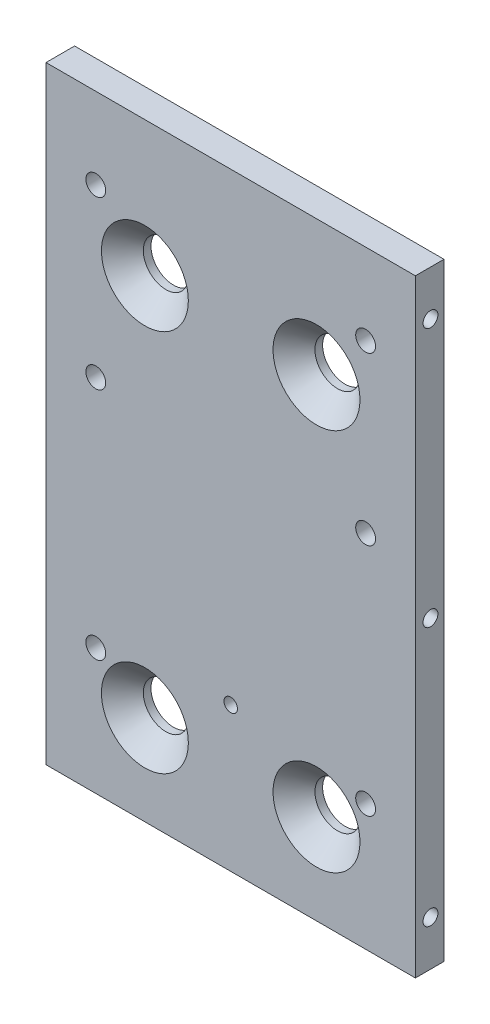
ISO-10303-21;
HEADER;
FILE_DESCRIPTION(('STEP AP214'),'2;1');
FILE_NAME('part.step','',(''),(''),'','','');
FILE_SCHEMA(('AUTOMOTIVE_DESIGN { 1 0 10303 214 1 1 1 1 }'));
ENDSEC;
DATA;
#1=APPLICATION_CONTEXT('core data for automotive mechanical design processes');
#2=APPLICATION_PROTOCOL_DEFINITION('international standard','automotive_design',2000,#1);
#3=PRODUCT_CONTEXT('',#1,'mechanical');
#4=PRODUCT('Part','Part','',(#3));
#5=PRODUCT_RELATED_PRODUCT_CATEGORY('part','',(#4));
#6=PRODUCT_DEFINITION_FORMATION('','',#4);
#7=PRODUCT_DEFINITION_CONTEXT('part definition',#1,'design');
#8=PRODUCT_DEFINITION('design','',#6,#7);
#9=PRODUCT_DEFINITION_SHAPE('','',#8);
#10=(LENGTH_UNIT() NAMED_UNIT(*) SI_UNIT(.MILLI.,.METRE.));
#11=(NAMED_UNIT(*) PLANE_ANGLE_UNIT() SI_UNIT($,.RADIAN.));
#12=(NAMED_UNIT(*) SI_UNIT($,.STERADIAN.) SOLID_ANGLE_UNIT());
#13=UNCERTAINTY_MEASURE_WITH_UNIT(LENGTH_MEASURE(1.E-05),#10,'distance_accuracy_value','');
#14=(GEOMETRIC_REPRESENTATION_CONTEXT(3) GLOBAL_UNCERTAINTY_ASSIGNED_CONTEXT((#13)) GLOBAL_UNIT_ASSIGNED_CONTEXT((#10,
#11,#12)) REPRESENTATION_CONTEXT('',''));
#15=CARTESIAN_POINT('',(0.,0.,0.));
#16=DIRECTION('',(0.,0.,1.));
#17=DIRECTION('',(1.,0.,0.));
#18=AXIS2_PLACEMENT_3D('',#15,#16,#17);
#19=CARTESIAN_POINT('',(0.,0.,6.35));
#20=DIRECTION('',(0.,0.,-1.));
#21=DIRECTION('',(-1.,0.,0.));
#22=AXIS2_PLACEMENT_3D('',#19,#20,#21);
#23=PLANE('',#22);
#24=CARTESIAN_POINT('',(29.95,-39.5,6.34999999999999));
#25=DIRECTION('',(0.,0.,-1.));
#26=DIRECTION('',(-1.,0.,0.));
#27=AXIS2_PLACEMENT_3D('',#24,#25,#26);
#28=CIRCLE('',#27,2.20000000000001);
#29=CARTESIAN_POINT('',(27.75,-39.5,6.34999999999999));
#30=VERTEX_POINT('',#29);
#31=EDGE_CURVE('E225',#30,#30,#28,.T.);
#32=ORIENTED_EDGE('',*,*,#31,.T.);
#33=EDGE_LOOP('',(#32));
#34=FACE_BOUND('',#33,.T.);
#35=CARTESIAN_POINT('',(29.95,12.5,6.34999999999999));
#36=DIRECTION('',(0.,0.,-1.));
#37=DIRECTION('',(-1.,0.,0.));
#38=AXIS2_PLACEMENT_3D('',#35,#36,#37);
#39=CIRCLE('',#38,2.20000000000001);
#40=CARTESIAN_POINT('',(27.75,12.5,6.34999999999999));
#41=VERTEX_POINT('',#40);
#42=EDGE_CURVE('E213',#41,#41,#39,.T.);
#43=ORIENTED_EDGE('',*,*,#42,.T.);
#44=EDGE_LOOP('',(#43));
#45=FACE_BOUND('',#44,.T.);
#46=CARTESIAN_POINT('',(29.95,49.5,6.34999999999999));
#47=DIRECTION('',(0.,0.,-1.));
#48=DIRECTION('',(-1.,0.,0.));
#49=AXIS2_PLACEMENT_3D('',#46,#47,#48);
#50=CIRCLE('',#49,2.20000000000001);
#51=CARTESIAN_POINT('',(27.75,49.5,6.34999999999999));
#52=VERTEX_POINT('',#51);
#53=EDGE_CURVE('E201',#52,#52,#50,.T.);
#54=ORIENTED_EDGE('',*,*,#53,.T.);
#55=EDGE_LOOP('',(#54));
#56=FACE_BOUND('',#55,.T.);
#57=CARTESIAN_POINT('',(-29.95,49.5,6.34999999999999));
#58=DIRECTION('',(0.,0.,-1.));
#59=DIRECTION('',(-1.,0.,0.));
#60=AXIS2_PLACEMENT_3D('',#57,#58,#59);
#61=CIRCLE('',#60,2.20000000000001);
#62=CARTESIAN_POINT('',(-32.15,49.5,6.34999999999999));
#63=VERTEX_POINT('',#62);
#64=EDGE_CURVE('E189',#63,#63,#61,.T.);
#65=ORIENTED_EDGE('',*,*,#64,.T.);
#66=EDGE_LOOP('',(#65));
#67=FACE_BOUND('',#66,.T.);
#68=CARTESIAN_POINT('',(-29.95,12.5,6.34999999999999));
#69=DIRECTION('',(0.,0.,-1.));
#70=DIRECTION('',(-1.,0.,0.));
#71=AXIS2_PLACEMENT_3D('',#68,#69,#70);
#72=CIRCLE('',#71,2.20000000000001);
#73=CARTESIAN_POINT('',(-32.15,12.5,6.34999999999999));
#74=VERTEX_POINT('',#73);
#75=EDGE_CURVE('E177',#74,#74,#72,.T.);
#76=ORIENTED_EDGE('',*,*,#75,.T.);
#77=EDGE_LOOP('',(#76));
#78=FACE_BOUND('',#77,.T.);
#79=CARTESIAN_POINT('',(-29.95,-39.5,6.34999999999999));
#80=DIRECTION('',(0.,0.,-1.));
#81=DIRECTION('',(-1.,0.,0.));
#82=AXIS2_PLACEMENT_3D('',#79,#80,#81);
#83=CIRCLE('',#82,2.20000000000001);
#84=CARTESIAN_POINT('',(-32.15,-39.5,6.34999999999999));
#85=VERTEX_POINT('',#84);
#86=EDGE_CURVE('E163',#85,#85,#83,.T.);
#87=ORIENTED_EDGE('',*,*,#86,.T.);
#88=EDGE_LOOP('',(#87));
#89=FACE_BOUND('',#88,.T.);
#90=CARTESIAN_POINT('',(0.,-35.5,6.35));
#91=DIRECTION('',(0.,0.,-1.));
#92=DIRECTION('',(-1.,0.,0.));
#93=AXIS2_PLACEMENT_3D('',#90,#91,#92);
#94=CIRCLE('',#93,1.5);
#95=CARTESIAN_POINT('',(-1.5,-35.5,6.35));
#96=VERTEX_POINT('',#95);
#97=EDGE_CURVE('E159',#96,#96,#94,.T.);
#98=ORIENTED_EDGE('',*,*,#97,.T.);
#99=EDGE_LOOP('',(#98));
#100=FACE_BOUND('',#99,.T.);
#101=CARTESIAN_POINT('',(-19.05,37.5,6.35));
#102=DIRECTION('',(0.,0.,1.));
#103=DIRECTION('',(1.,0.,0.));
#104=AXIS2_PLACEMENT_3D('',#101,#102,#103);
#105=CIRCLE('',#104,9.65);
#106=CARTESIAN_POINT('',(-9.4,37.5,6.35));
#107=VERTEX_POINT('',#106);
#108=EDGE_CURVE('E156',#107,#107,#105,.T.);
#109=ORIENTED_EDGE('',*,*,#108,.F.);
#110=EDGE_LOOP('',(#109));
#111=FACE_BOUND('',#110,.T.);
#112=CARTESIAN_POINT('',(19.05,37.5,6.35));
#113=DIRECTION('',(0.,0.,1.));
#114=DIRECTION('',(1.,0.,0.));
#115=AXIS2_PLACEMENT_3D('',#112,#113,#114);
#116=CIRCLE('',#115,9.65);
#117=CARTESIAN_POINT('',(28.7,37.5,6.35));
#118=VERTEX_POINT('',#117);
#119=EDGE_CURVE('E147',#118,#118,#116,.T.);
#120=ORIENTED_EDGE('',*,*,#119,.F.);
#121=EDGE_LOOP('',(#120));
#122=FACE_BOUND('',#121,.T.);
#123=CARTESIAN_POINT('',(-19.05,-47.5,6.35));
#124=DIRECTION('',(0.,0.,1.));
#125=DIRECTION('',(1.,0.,0.));
#126=AXIS2_PLACEMENT_3D('',#123,#124,#125);
#127=CIRCLE('',#126,9.65);
#128=CARTESIAN_POINT('',(-9.4,-47.5,6.35));
#129=VERTEX_POINT('',#128);
#130=EDGE_CURVE('E138',#129,#129,#127,.T.);
#131=ORIENTED_EDGE('',*,*,#130,.F.);
#132=EDGE_LOOP('',(#131));
#133=FACE_BOUND('',#132,.T.);
#134=DIRECTION('',(0.,-1.,0.));
#135=VECTOR('',#134,1.);
#136=CARTESIAN_POINT('',(-41.,67.5,6.35));
#137=LINE('',#136,#135);
#138=CARTESIAN_POINT('',(-41.,67.5,6.35));
#139=VERTEX_POINT('',#138);
#140=CARTESIAN_POINT('',(-41.,-67.5,6.35));
#141=VERTEX_POINT('',#140);
#142=EDGE_CURVE('E97',#139,#141,#137,.T.);
#143=ORIENTED_EDGE('',*,*,#142,.T.);
#144=DIRECTION('',(1.,0.,0.));
#145=VECTOR('',#144,1.);
#146=CARTESIAN_POINT('',(41.,-67.5,6.35));
#147=LINE('',#146,#145);
#148=CARTESIAN_POINT('',(41.,-67.5,6.35));
#149=VERTEX_POINT('',#148);
#150=EDGE_CURVE('E92',#141,#149,#147,.T.);
#151=ORIENTED_EDGE('',*,*,#150,.T.);
#152=DIRECTION('',(0.,1.,0.));
#153=VECTOR('',#152,1.);
#154=CARTESIAN_POINT('',(41.,67.5,6.35));
#155=LINE('',#154,#153);
#156=CARTESIAN_POINT('',(41.,67.5,6.35));
#157=VERTEX_POINT('',#156);
#158=EDGE_CURVE('E95',#149,#157,#155,.T.);
#159=ORIENTED_EDGE('',*,*,#158,.T.);
#160=DIRECTION('',(-1.,0.,0.));
#161=VECTOR('',#160,1.);
#162=CARTESIAN_POINT('',(41.,67.5,6.35));
#163=LINE('',#162,#161);
#164=EDGE_CURVE('E62',#157,#139,#163,.T.);
#165=ORIENTED_EDGE('',*,*,#164,.T.);
#166=EDGE_LOOP('',(#143,#151,#159,#165));
#167=FACE_BOUND('',#166,.T.);
#168=CARTESIAN_POINT('',(19.05,-47.5,6.35));
#169=DIRECTION('',(0.,0.,1.));
#170=DIRECTION('',(1.,0.,0.));
#171=AXIS2_PLACEMENT_3D('',#168,#169,#170);
#172=CIRCLE('',#171,9.65);
#173=CARTESIAN_POINT('',(28.7,-47.5,6.35));
#174=VERTEX_POINT('',#173);
#175=EDGE_CURVE('E129',#174,#174,#172,.T.);
#176=ORIENTED_EDGE('',*,*,#175,.F.);
#177=EDGE_LOOP('',(#176));
#178=FACE_BOUND('',#177,.T.);
#179=ADVANCED_FACE('F45',(#34,#45,#56,#67,#78,#89,#100,#111,#122,#133,#167,#178),#23,.F.);
#180=CARTESIAN_POINT('',(0.,0.,0.));
#181=DIRECTION('',(0.,0.,-1.));
#182=DIRECTION('',(-1.,0.,0.));
#183=AXIS2_PLACEMENT_3D('',#180,#181,#182);
#184=PLANE('',#183);
#185=CARTESIAN_POINT('',(29.95,-39.5,0.));
#186=DIRECTION('',(0.,0.,-1.));
#187=DIRECTION('',(-1.,0.,0.));
#188=AXIS2_PLACEMENT_3D('',#185,#186,#187);
#189=CIRCLE('',#188,3.75000000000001);
#190=CARTESIAN_POINT('',(26.2,-39.5,0.));
#191=VERTEX_POINT('',#190);
#192=EDGE_CURVE('E234',#191,#191,#189,.T.);
#193=ORIENTED_EDGE('',*,*,#192,.F.);
#194=EDGE_LOOP('',(#193));
#195=FACE_BOUND('',#194,.T.);
#196=CARTESIAN_POINT('',(29.95,12.5,0.));
#197=DIRECTION('',(0.,0.,-1.));
#198=DIRECTION('',(-1.,0.,0.));
#199=AXIS2_PLACEMENT_3D('',#196,#197,#198);
#200=CIRCLE('',#199,3.75000000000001);
#201=CARTESIAN_POINT('',(26.2,12.5,0.));
#202=VERTEX_POINT('',#201);
#203=EDGE_CURVE('E222',#202,#202,#200,.T.);
#204=ORIENTED_EDGE('',*,*,#203,.F.);
#205=EDGE_LOOP('',(#204));
#206=FACE_BOUND('',#205,.T.);
#207=CARTESIAN_POINT('',(29.95,49.5,0.));
#208=DIRECTION('',(0.,0.,-1.));
#209=DIRECTION('',(-1.,0.,0.));
#210=AXIS2_PLACEMENT_3D('',#207,#208,#209);
#211=CIRCLE('',#210,3.75000000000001);
#212=CARTESIAN_POINT('',(26.2,49.5,0.));
#213=VERTEX_POINT('',#212);
#214=EDGE_CURVE('E210',#213,#213,#211,.T.);
#215=ORIENTED_EDGE('',*,*,#214,.F.);
#216=EDGE_LOOP('',(#215));
#217=FACE_BOUND('',#216,.T.);
#218=CARTESIAN_POINT('',(-29.95,49.5,0.));
#219=DIRECTION('',(0.,0.,-1.));
#220=DIRECTION('',(-1.,0.,0.));
#221=AXIS2_PLACEMENT_3D('',#218,#219,#220);
#222=CIRCLE('',#221,3.75000000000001);
#223=CARTESIAN_POINT('',(-33.7,49.5,0.));
#224=VERTEX_POINT('',#223);
#225=EDGE_CURVE('E198',#224,#224,#222,.T.);
#226=ORIENTED_EDGE('',*,*,#225,.F.);
#227=EDGE_LOOP('',(#226));
#228=FACE_BOUND('',#227,.T.);
#229=CARTESIAN_POINT('',(-29.95,12.5,0.));
#230=DIRECTION('',(0.,0.,-1.));
#231=DIRECTION('',(-1.,0.,0.));
#232=AXIS2_PLACEMENT_3D('',#229,#230,#231);
#233=CIRCLE('',#232,3.75000000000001);
#234=CARTESIAN_POINT('',(-33.7,12.5,0.));
#235=VERTEX_POINT('',#234);
#236=EDGE_CURVE('E186',#235,#235,#233,.T.);
#237=ORIENTED_EDGE('',*,*,#236,.F.);
#238=EDGE_LOOP('',(#237));
#239=FACE_BOUND('',#238,.T.);
#240=CARTESIAN_POINT('',(-29.95,-39.5,0.));
#241=DIRECTION('',(0.,0.,-1.));
#242=DIRECTION('',(-1.,0.,0.));
#243=AXIS2_PLACEMENT_3D('',#240,#241,#242);
#244=CIRCLE('',#243,3.75000000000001);
#245=CARTESIAN_POINT('',(-33.7,-39.5,0.));
#246=VERTEX_POINT('',#245);
#247=EDGE_CURVE('E174',#246,#246,#244,.T.);
#248=ORIENTED_EDGE('',*,*,#247,.F.);
#249=EDGE_LOOP('',(#248));
#250=FACE_BOUND('',#249,.T.);
#251=CARTESIAN_POINT('',(0.,-35.5,0.));
#252=DIRECTION('',(0.,0.,-1.));
#253=DIRECTION('',(-1.,0.,0.));
#254=AXIS2_PLACEMENT_3D('',#251,#252,#253);
#255=CIRCLE('',#254,1.5);
#256=CARTESIAN_POINT('',(-1.5,-35.5,0.));
#257=VERTEX_POINT('',#256);
#258=EDGE_CURVE('E160',#257,#257,#255,.T.);
#259=ORIENTED_EDGE('',*,*,#258,.F.);
#260=EDGE_LOOP('',(#259));
#261=FACE_BOUND('',#260,.T.);
#262=CARTESIAN_POINT('',(-19.05,37.5,0.));
#263=DIRECTION('',(0.,0.,1.));
#264=DIRECTION('',(1.,0.,0.));
#265=AXIS2_PLACEMENT_3D('',#262,#263,#264);
#266=CIRCLE('',#265,5.);
#267=CARTESIAN_POINT('',(-14.05,37.5,0.));
#268=VERTEX_POINT('',#267);
#269=EDGE_CURVE('E150',#268,#268,#266,.T.);
#270=ORIENTED_EDGE('',*,*,#269,.T.);
#271=EDGE_LOOP('',(#270));
#272=FACE_BOUND('',#271,.T.);
#273=CARTESIAN_POINT('',(19.05,37.5,0.));
#274=DIRECTION('',(0.,0.,1.));
#275=DIRECTION('',(1.,0.,0.));
#276=AXIS2_PLACEMENT_3D('',#273,#274,#275);
#277=CIRCLE('',#276,5.);
#278=CARTESIAN_POINT('',(24.05,37.5,0.));
#279=VERTEX_POINT('',#278);
#280=EDGE_CURVE('E141',#279,#279,#277,.T.);
#281=ORIENTED_EDGE('',*,*,#280,.T.);
#282=EDGE_LOOP('',(#281));
#283=FACE_BOUND('',#282,.T.);
#284=CARTESIAN_POINT('',(-19.05,-47.5,0.));
#285=DIRECTION('',(0.,0.,1.));
#286=DIRECTION('',(1.,0.,0.));
#287=AXIS2_PLACEMENT_3D('',#284,#285,#286);
#288=CIRCLE('',#287,5.);
#289=CARTESIAN_POINT('',(-14.05,-47.5,0.));
#290=VERTEX_POINT('',#289);
#291=EDGE_CURVE('E132',#290,#290,#288,.T.);
#292=ORIENTED_EDGE('',*,*,#291,.T.);
#293=EDGE_LOOP('',(#292));
#294=FACE_BOUND('',#293,.T.);
#295=DIRECTION('',(0.,-1.,0.));
#296=VECTOR('',#295,1.);
#297=CARTESIAN_POINT('',(-41.,67.5,0.));
#298=LINE('',#297,#296);
#299=CARTESIAN_POINT('',(-41.,67.5,0.));
#300=VERTEX_POINT('',#299);
#301=CARTESIAN_POINT('',(-41.,-67.5,0.));
#302=VERTEX_POINT('',#301);
#303=EDGE_CURVE('E109',#300,#302,#298,.T.);
#304=ORIENTED_EDGE('',*,*,#303,.F.);
#305=DIRECTION('',(-1.,0.,0.));
#306=VECTOR('',#305,1.);
#307=CARTESIAN_POINT('',(41.,67.5,0.));
#308=LINE('',#307,#306);
#309=CARTESIAN_POINT('',(41.,67.5,0.));
#310=VERTEX_POINT('',#309);
#311=EDGE_CURVE('E85',#310,#300,#308,.T.);
#312=ORIENTED_EDGE('',*,*,#311,.F.);
#313=DIRECTION('',(0.,1.,0.));
#314=VECTOR('',#313,1.);
#315=CARTESIAN_POINT('',(41.,67.5,0.));
#316=LINE('',#315,#314);
#317=CARTESIAN_POINT('',(41.,-67.5,0.));
#318=VERTEX_POINT('',#317);
#319=EDGE_CURVE('E79',#318,#310,#316,.T.);
#320=ORIENTED_EDGE('',*,*,#319,.F.);
#321=DIRECTION('',(1.,0.,0.));
#322=VECTOR('',#321,1.);
#323=CARTESIAN_POINT('',(41.,-67.5,0.));
#324=LINE('',#323,#322);
#325=EDGE_CURVE('E101',#302,#318,#324,.T.);
#326=ORIENTED_EDGE('',*,*,#325,.F.);
#327=EDGE_LOOP('',(#304,#312,#320,#326));
#328=FACE_BOUND('',#327,.T.);
#329=CARTESIAN_POINT('',(19.05,-47.5,0.));
#330=DIRECTION('',(0.,0.,1.));
#331=DIRECTION('',(1.,0.,0.));
#332=AXIS2_PLACEMENT_3D('',#329,#330,#331);
#333=CIRCLE('',#332,5.);
#334=CARTESIAN_POINT('',(24.05,-47.5,0.));
#335=VERTEX_POINT('',#334);
#336=EDGE_CURVE('E112',#335,#335,#333,.T.);
#337=ORIENTED_EDGE('',*,*,#336,.T.);
#338=EDGE_LOOP('',(#337));
#339=FACE_BOUND('',#338,.T.);
#340=ADVANCED_FACE('F120',(#195,#206,#217,#228,#239,#250,#261,#272,#283,#294,#328,#339),#184,.T.);
#341=CARTESIAN_POINT('',(-41.,67.5,6.35));
#342=DIRECTION('',(1.,0.,0.));
#343=DIRECTION('',(0.,1.,0.));
#344=AXIS2_PLACEMENT_3D('',#341,#342,#343);
#345=PLANE('',#344);
#346=CARTESIAN_POINT('',(-41.,0.,3.));
#347=DIRECTION('',(1.,0.,0.));
#348=DIRECTION('',(0.,1.,0.));
#349=AXIS2_PLACEMENT_3D('',#346,#347,#348);
#350=CIRCLE('',#349,1.65);
#351=CARTESIAN_POINT('',(-41.,1.64999999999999,3.));
#352=VERTEX_POINT('',#351);
#353=EDGE_CURVE('E268',#352,#352,#350,.T.);
#354=ORIENTED_EDGE('',*,*,#353,.T.);
#355=EDGE_LOOP('',(#354));
#356=FACE_BOUND('',#355,.T.);
#357=CARTESIAN_POINT('',(-41.,-57.5,3.));
#358=DIRECTION('',(1.,0.,0.));
#359=DIRECTION('',(0.,1.,0.));
#360=AXIS2_PLACEMENT_3D('',#357,#358,#359);
#361=CIRCLE('',#360,1.65);
#362=CARTESIAN_POINT('',(-41.,-55.85,3.));
#363=VERTEX_POINT('',#362);
#364=EDGE_CURVE('E262',#363,#363,#361,.T.);
#365=ORIENTED_EDGE('',*,*,#364,.T.);
#366=EDGE_LOOP('',(#365));
#367=FACE_BOUND('',#366,.T.);
#368=CARTESIAN_POINT('',(-41.,57.5,3.));
#369=DIRECTION('',(1.,0.,0.));
#370=DIRECTION('',(0.,1.,0.));
#371=AXIS2_PLACEMENT_3D('',#368,#369,#370);
#372=CIRCLE('',#371,1.65);
#373=CARTESIAN_POINT('',(-41.,59.15,3.));
#374=VERTEX_POINT('',#373);
#375=EDGE_CURVE('E256',#374,#374,#372,.T.);
#376=ORIENTED_EDGE('',*,*,#375,.T.);
#377=EDGE_LOOP('',(#376));
#378=FACE_BOUND('',#377,.T.);
#379=ORIENTED_EDGE('',*,*,#303,.T.);
#380=DIRECTION('',(0.,0.,-1.));
#381=VECTOR('',#380,1.);
#382=CARTESIAN_POINT('',(-41.,-67.5,6.35));
#383=LINE('',#382,#381);
#384=EDGE_CURVE('E13',#141,#302,#383,.T.);
#385=ORIENTED_EDGE('',*,*,#384,.F.);
#386=ORIENTED_EDGE('',*,*,#142,.F.);
#387=DIRECTION('',(0.,0.,-1.));
#388=VECTOR('',#387,1.);
#389=CARTESIAN_POINT('',(-41.,67.5,6.35));
#390=LINE('',#389,#388);
#391=EDGE_CURVE('E105',#139,#300,#390,.T.);
#392=ORIENTED_EDGE('',*,*,#391,.T.);
#393=EDGE_LOOP('',(#379,#385,#386,#392));
#394=FACE_BOUND('',#393,.T.);
#395=ADVANCED_FACE('F47',(#356,#367,#378,#394),#345,.F.);
#396=CARTESIAN_POINT('',(41.,-67.5,6.35));
#397=DIRECTION('',(0.,1.,0.));
#398=DIRECTION('',(-1.,0.,0.));
#399=AXIS2_PLACEMENT_3D('',#396,#397,#398);
#400=PLANE('',#399);
#401=ORIENTED_EDGE('',*,*,#325,.T.);
#402=DIRECTION('',(0.,0.,-1.));
#403=VECTOR('',#402,1.);
#404=CARTESIAN_POINT('',(41.,-67.5,6.35));
#405=LINE('',#404,#403);
#406=EDGE_CURVE('E54',#149,#318,#405,.T.);
#407=ORIENTED_EDGE('',*,*,#406,.F.);
#408=ORIENTED_EDGE('',*,*,#150,.F.);
#409=ORIENTED_EDGE('',*,*,#384,.T.);
#410=EDGE_LOOP('',(#401,#407,#408,#409));
#411=FACE_BOUND('',#410,.T.);
#412=ADVANCED_FACE('F100',(#411),#400,.F.);
#413=CARTESIAN_POINT('',(41.,67.5,6.35));
#414=DIRECTION('',(-1.,0.,0.));
#415=DIRECTION('',(0.,-1.,0.));
#416=AXIS2_PLACEMENT_3D('',#413,#414,#415);
#417=PLANE('',#416);
#418=CARTESIAN_POINT('',(41.,0.,3.));
#419=DIRECTION('',(1.,0.,0.));
#420=DIRECTION('',(0.,1.,0.));
#421=AXIS2_PLACEMENT_3D('',#418,#419,#420);
#422=CIRCLE('',#421,1.65);
#423=CARTESIAN_POINT('',(41.,1.64999999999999,3.));
#424=VERTEX_POINT('',#423);
#425=EDGE_CURVE('E251',#424,#424,#422,.T.);
#426=ORIENTED_EDGE('',*,*,#425,.F.);
#427=EDGE_LOOP('',(#426));
#428=FACE_BOUND('',#427,.T.);
#429=CARTESIAN_POINT('',(41.,-57.5,3.));
#430=DIRECTION('',(1.,0.,0.));
#431=DIRECTION('',(0.,1.,0.));
#432=AXIS2_PLACEMENT_3D('',#429,#430,#431);
#433=CIRCLE('',#432,1.65);
#434=CARTESIAN_POINT('',(41.,-55.85,3.));
#435=VERTEX_POINT('',#434);
#436=EDGE_CURVE('E244',#435,#435,#433,.T.);
#437=ORIENTED_EDGE('',*,*,#436,.F.);
#438=EDGE_LOOP('',(#437));
#439=FACE_BOUND('',#438,.T.);
#440=CARTESIAN_POINT('',(41.,57.5,3.));
#441=DIRECTION('',(1.,0.,0.));
#442=DIRECTION('',(0.,1.,0.));
#443=AXIS2_PLACEMENT_3D('',#440,#441,#442);
#444=CIRCLE('',#443,1.65);
#445=CARTESIAN_POINT('',(41.,59.15,3.));
#446=VERTEX_POINT('',#445);
#447=EDGE_CURVE('E238',#446,#446,#444,.T.);
#448=ORIENTED_EDGE('',*,*,#447,.F.);
#449=EDGE_LOOP('',(#448));
#450=FACE_BOUND('',#449,.T.);
#451=ORIENTED_EDGE('',*,*,#319,.T.);
#452=DIRECTION('',(0.,0.,-1.));
#453=VECTOR('',#452,1.);
#454=CARTESIAN_POINT('',(41.,67.5,6.35));
#455=LINE('',#454,#453);
#456=EDGE_CURVE('E102',#157,#310,#455,.T.);
#457=ORIENTED_EDGE('',*,*,#456,.F.);
#458=ORIENTED_EDGE('',*,*,#158,.F.);
#459=ORIENTED_EDGE('',*,*,#406,.T.);
#460=EDGE_LOOP('',(#451,#457,#458,#459));
#461=FACE_BOUND('',#460,.T.);
#462=ADVANCED_FACE('F103',(#428,#439,#450,#461),#417,.F.);
#463=CARTESIAN_POINT('',(41.,67.5,6.35));
#464=DIRECTION('',(0.,-1.,0.));
#465=DIRECTION('',(1.,0.,0.));
#466=AXIS2_PLACEMENT_3D('',#463,#464,#465);
#467=PLANE('',#466);
#468=ORIENTED_EDGE('',*,*,#311,.T.);
#469=ORIENTED_EDGE('',*,*,#391,.F.);
#470=ORIENTED_EDGE('',*,*,#164,.F.);
#471=ORIENTED_EDGE('',*,*,#456,.T.);
#472=EDGE_LOOP('',(#468,#469,#470,#471));
#473=FACE_BOUND('',#472,.T.);
#474=ADVANCED_FACE('F117',(#473),#467,.F.);
#475=CARTESIAN_POINT('',(19.05,-47.5,6.35));
#476=DIRECTION('',(0.,0.,1.));
#477=DIRECTION('',(1.,0.,0.));
#478=AXIS2_PLACEMENT_3D('',#475,#476,#477);
#479=CYLINDRICAL_SURFACE('',#478,5.);
#480=ORIENTED_EDGE('',*,*,#336,.F.);
#481=EDGE_LOOP('',(#480));
#482=FACE_BOUND('',#481,.T.);
#483=CARTESIAN_POINT('',(19.05,-47.5,1.7));
#484=DIRECTION('',(0.,0.,1.));
#485=DIRECTION('',(1.,0.,0.));
#486=AXIS2_PLACEMENT_3D('',#483,#484,#485);
#487=CIRCLE('',#486,5.);
#488=CARTESIAN_POINT('',(24.05,-47.5,1.7));
#489=VERTEX_POINT('',#488);
#490=EDGE_CURVE('E126',#489,#489,#487,.T.);
#491=ORIENTED_EDGE('',*,*,#490,.T.);
#492=EDGE_LOOP('',(#491));
#493=FACE_BOUND('',#492,.T.);
#494=ADVANCED_FACE('F295',(#482,#493),#479,.F.);
#495=CARTESIAN_POINT('',(19.05,-47.5,6.35));
#496=DIRECTION('',(0.,0.,1.));
#497=DIRECTION('',(1.,0.,0.));
#498=AXIS2_PLACEMENT_3D('',#495,#496,#497);
#499=CONICAL_SURFACE('',#498,9.65,0.785398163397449);
#500=ORIENTED_EDGE('',*,*,#490,.F.);
#501=EDGE_LOOP('',(#500));
#502=FACE_BOUND('',#501,.T.);
#503=ORIENTED_EDGE('',*,*,#175,.T.);
#504=EDGE_LOOP('',(#503));
#505=FACE_BOUND('',#504,.T.);
#506=ADVANCED_FACE('F450',(#502,#505),#499,.F.);
#507=CARTESIAN_POINT('',(-19.05,-47.5,6.35));
#508=DIRECTION('',(0.,0.,1.));
#509=DIRECTION('',(1.,0.,0.));
#510=AXIS2_PLACEMENT_3D('',#507,#508,#509);
#511=CYLINDRICAL_SURFACE('',#510,5.);
#512=ORIENTED_EDGE('',*,*,#291,.F.);
#513=EDGE_LOOP('',(#512));
#514=FACE_BOUND('',#513,.T.);
#515=CARTESIAN_POINT('',(-19.05,-47.5,1.7));
#516=DIRECTION('',(0.,0.,1.));
#517=DIRECTION('',(1.,0.,0.));
#518=AXIS2_PLACEMENT_3D('',#515,#516,#517);
#519=CIRCLE('',#518,5.);
#520=CARTESIAN_POINT('',(-14.05,-47.5,1.7));
#521=VERTEX_POINT('',#520);
#522=EDGE_CURVE('E135',#521,#521,#519,.T.);
#523=ORIENTED_EDGE('',*,*,#522,.T.);
#524=EDGE_LOOP('',(#523));
#525=FACE_BOUND('',#524,.T.);
#526=ADVANCED_FACE('F447',(#514,#525),#511,.F.);
#527=CARTESIAN_POINT('',(-19.05,-47.5,6.35));
#528=DIRECTION('',(0.,0.,1.));
#529=DIRECTION('',(1.,0.,0.));
#530=AXIS2_PLACEMENT_3D('',#527,#528,#529);
#531=CONICAL_SURFACE('',#530,9.65,0.785398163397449);
#532=ORIENTED_EDGE('',*,*,#522,.F.);
#533=EDGE_LOOP('',(#532));
#534=FACE_BOUND('',#533,.T.);
#535=ORIENTED_EDGE('',*,*,#130,.T.);
#536=EDGE_LOOP('',(#535));
#537=FACE_BOUND('',#536,.T.);
#538=ADVANCED_FACE('F443',(#534,#537),#531,.F.);
#539=CARTESIAN_POINT('',(19.05,37.5,6.35));
#540=DIRECTION('',(0.,0.,1.));
#541=DIRECTION('',(1.,0.,0.));
#542=AXIS2_PLACEMENT_3D('',#539,#540,#541);
#543=CYLINDRICAL_SURFACE('',#542,5.);
#544=ORIENTED_EDGE('',*,*,#280,.F.);
#545=EDGE_LOOP('',(#544));
#546=FACE_BOUND('',#545,.T.);
#547=CARTESIAN_POINT('',(19.05,37.5,1.7));
#548=DIRECTION('',(0.,0.,1.));
#549=DIRECTION('',(1.,0.,0.));
#550=AXIS2_PLACEMENT_3D('',#547,#548,#549);
#551=CIRCLE('',#550,5.);
#552=CARTESIAN_POINT('',(24.05,37.5,1.7));
#553=VERTEX_POINT('',#552);
#554=EDGE_CURVE('E144',#553,#553,#551,.T.);
#555=ORIENTED_EDGE('',*,*,#554,.T.);
#556=EDGE_LOOP('',(#555));
#557=FACE_BOUND('',#556,.T.);
#558=ADVANCED_FACE('F439',(#546,#557),#543,.F.);
#559=CARTESIAN_POINT('',(19.05,37.5,6.35));
#560=DIRECTION('',(0.,0.,1.));
#561=DIRECTION('',(1.,0.,0.));
#562=AXIS2_PLACEMENT_3D('',#559,#560,#561);
#563=CONICAL_SURFACE('',#562,9.65,0.785398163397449);
#564=ORIENTED_EDGE('',*,*,#554,.F.);
#565=EDGE_LOOP('',(#564));
#566=FACE_BOUND('',#565,.T.);
#567=ORIENTED_EDGE('',*,*,#119,.T.);
#568=EDGE_LOOP('',(#567));
#569=FACE_BOUND('',#568,.T.);
#570=ADVANCED_FACE('F435',(#566,#569),#563,.F.);
#571=CARTESIAN_POINT('',(-19.05,37.5,6.35));
#572=DIRECTION('',(0.,0.,1.));
#573=DIRECTION('',(1.,0.,0.));
#574=AXIS2_PLACEMENT_3D('',#571,#572,#573);
#575=CYLINDRICAL_SURFACE('',#574,5.);
#576=ORIENTED_EDGE('',*,*,#269,.F.);
#577=EDGE_LOOP('',(#576));
#578=FACE_BOUND('',#577,.T.);
#579=CARTESIAN_POINT('',(-19.05,37.5,1.7));
#580=DIRECTION('',(0.,0.,1.));
#581=DIRECTION('',(1.,0.,0.));
#582=AXIS2_PLACEMENT_3D('',#579,#580,#581);
#583=CIRCLE('',#582,5.);
#584=CARTESIAN_POINT('',(-14.05,37.5,1.7));
#585=VERTEX_POINT('',#584);
#586=EDGE_CURVE('E153',#585,#585,#583,.T.);
#587=ORIENTED_EDGE('',*,*,#586,.T.);
#588=EDGE_LOOP('',(#587));
#589=FACE_BOUND('',#588,.T.);
#590=ADVANCED_FACE('F431',(#578,#589),#575,.F.);
#591=CARTESIAN_POINT('',(-19.05,37.5,6.35));
#592=DIRECTION('',(0.,0.,1.));
#593=DIRECTION('',(1.,0.,0.));
#594=AXIS2_PLACEMENT_3D('',#591,#592,#593);
#595=CONICAL_SURFACE('',#594,9.65,0.785398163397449);
#596=ORIENTED_EDGE('',*,*,#586,.F.);
#597=EDGE_LOOP('',(#596));
#598=FACE_BOUND('',#597,.T.);
#599=ORIENTED_EDGE('',*,*,#108,.T.);
#600=EDGE_LOOP('',(#599));
#601=FACE_BOUND('',#600,.T.);
#602=ADVANCED_FACE('F427',(#598,#601),#595,.F.);
#603=CARTESIAN_POINT('',(0.,-35.5,6.35));
#604=DIRECTION('',(0.,0.,-1.));
#605=DIRECTION('',(-1.,0.,0.));
#606=AXIS2_PLACEMENT_3D('',#603,#604,#605);
#607=CYLINDRICAL_SURFACE('',#606,1.5);
#608=ORIENTED_EDGE('',*,*,#97,.F.);
#609=EDGE_LOOP('',(#608));
#610=FACE_BOUND('',#609,.T.);
#611=ORIENTED_EDGE('',*,*,#258,.T.);
#612=EDGE_LOOP('',(#611));
#613=FACE_BOUND('',#612,.T.);
#614=ADVANCED_FACE('F423',(#610,#613),#607,.F.);
#615=CARTESIAN_POINT('',(-29.95,-39.5,0.));
#616=DIRECTION('',(0.,0.,-1.));
#617=DIRECTION('',(-1.,0.,0.));
#618=AXIS2_PLACEMENT_3D('',#615,#616,#617);
#619=CYLINDRICAL_SURFACE('',#618,2.20000000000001);
#620=ORIENTED_EDGE('',*,*,#86,.F.);
#621=EDGE_LOOP('',(#620));
#622=FACE_BOUND('',#621,.T.);
#623=CARTESIAN_POINT('',(-29.95,-39.5,3.));
#624=DIRECTION('',(0.,0.,-1.));
#625=DIRECTION('',(-1.,0.,0.));
#626=AXIS2_PLACEMENT_3D('',#623,#624,#625);
#627=CIRCLE('',#626,2.20000000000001);
#628=CARTESIAN_POINT('',(-32.15,-39.5,3.));
#629=VERTEX_POINT('',#628);
#630=EDGE_CURVE('E168',#629,#629,#627,.T.);
#631=ORIENTED_EDGE('',*,*,#630,.T.);
#632=EDGE_LOOP('',(#631));
#633=FACE_BOUND('',#632,.T.);
#634=ADVANCED_FACE('F419',(#622,#633),#619,.F.);
#635=CARTESIAN_POINT('',(-27.75,-39.5,3.));
#636=DIRECTION('',(0.,0.,1.));
#637=DIRECTION('',(1.,0.,0.));
#638=AXIS2_PLACEMENT_3D('',#635,#636,#637);
#639=PLANE('',#638);
#640=ORIENTED_EDGE('',*,*,#630,.F.);
#641=EDGE_LOOP('',(#640));
#642=FACE_BOUND('',#641,.T.);
#643=CARTESIAN_POINT('',(-29.95,-39.5,3.));
#644=DIRECTION('',(0.,0.,-1.));
#645=DIRECTION('',(-1.,0.,0.));
#646=AXIS2_PLACEMENT_3D('',#643,#644,#645);
#647=CIRCLE('',#646,3.75000000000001);
#648=CARTESIAN_POINT('',(-33.7,-39.5,3.));
#649=VERTEX_POINT('',#648);
#650=EDGE_CURVE('E171',#649,#649,#647,.T.);
#651=ORIENTED_EDGE('',*,*,#650,.T.);
#652=EDGE_LOOP('',(#651));
#653=FACE_BOUND('',#652,.T.);
#654=ADVANCED_FACE('F415',(#642,#653),#639,.F.);
#655=CARTESIAN_POINT('',(-29.95,-39.5,0.));
#656=DIRECTION('',(0.,0.,-1.));
#657=DIRECTION('',(-1.,0.,0.));
#658=AXIS2_PLACEMENT_3D('',#655,#656,#657);
#659=CYLINDRICAL_SURFACE('',#658,3.75000000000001);
#660=ORIENTED_EDGE('',*,*,#650,.F.);
#661=EDGE_LOOP('',(#660));
#662=FACE_BOUND('',#661,.T.);
#663=ORIENTED_EDGE('',*,*,#247,.T.);
#664=EDGE_LOOP('',(#663));
#665=FACE_BOUND('',#664,.T.);
#666=ADVANCED_FACE('F411',(#662,#665),#659,.F.);
#667=CARTESIAN_POINT('',(-29.95,12.5,0.));
#668=DIRECTION('',(0.,0.,-1.));
#669=DIRECTION('',(-1.,0.,0.));
#670=AXIS2_PLACEMENT_3D('',#667,#668,#669);
#671=CYLINDRICAL_SURFACE('',#670,2.20000000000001);
#672=ORIENTED_EDGE('',*,*,#75,.F.);
#673=EDGE_LOOP('',(#672));
#674=FACE_BOUND('',#673,.T.);
#675=CARTESIAN_POINT('',(-29.95,12.5,3.));
#676=DIRECTION('',(0.,0.,-1.));
#677=DIRECTION('',(-1.,0.,0.));
#678=AXIS2_PLACEMENT_3D('',#675,#676,#677);
#679=CIRCLE('',#678,2.20000000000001);
#680=CARTESIAN_POINT('',(-32.15,12.5,3.));
#681=VERTEX_POINT('',#680);
#682=EDGE_CURVE('E180',#681,#681,#679,.T.);
#683=ORIENTED_EDGE('',*,*,#682,.T.);
#684=EDGE_LOOP('',(#683));
#685=FACE_BOUND('',#684,.T.);
#686=ADVANCED_FACE('F407',(#674,#685),#671,.F.);
#687=CARTESIAN_POINT('',(-27.75,12.5,3.));
#688=DIRECTION('',(0.,0.,1.));
#689=DIRECTION('',(1.,0.,0.));
#690=AXIS2_PLACEMENT_3D('',#687,#688,#689);
#691=PLANE('',#690);
#692=ORIENTED_EDGE('',*,*,#682,.F.);
#693=EDGE_LOOP('',(#692));
#694=FACE_BOUND('',#693,.T.);
#695=CARTESIAN_POINT('',(-29.95,12.5,3.));
#696=DIRECTION('',(0.,0.,-1.));
#697=DIRECTION('',(-1.,0.,0.));
#698=AXIS2_PLACEMENT_3D('',#695,#696,#697);
#699=CIRCLE('',#698,3.75000000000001);
#700=CARTESIAN_POINT('',(-33.7,12.5,3.));
#701=VERTEX_POINT('',#700);
#702=EDGE_CURVE('E183',#701,#701,#699,.T.);
#703=ORIENTED_EDGE('',*,*,#702,.T.);
#704=EDGE_LOOP('',(#703));
#705=FACE_BOUND('',#704,.T.);
#706=ADVANCED_FACE('F403',(#694,#705),#691,.F.);
#707=CARTESIAN_POINT('',(-29.95,12.5,0.));
#708=DIRECTION('',(0.,0.,-1.));
#709=DIRECTION('',(-1.,0.,0.));
#710=AXIS2_PLACEMENT_3D('',#707,#708,#709);
#711=CYLINDRICAL_SURFACE('',#710,3.75000000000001);
#712=ORIENTED_EDGE('',*,*,#702,.F.);
#713=EDGE_LOOP('',(#712));
#714=FACE_BOUND('',#713,.T.);
#715=ORIENTED_EDGE('',*,*,#236,.T.);
#716=EDGE_LOOP('',(#715));
#717=FACE_BOUND('',#716,.T.);
#718=ADVANCED_FACE('F399',(#714,#717),#711,.F.);
#719=CARTESIAN_POINT('',(-29.95,49.5,0.));
#720=DIRECTION('',(0.,0.,-1.));
#721=DIRECTION('',(-1.,0.,0.));
#722=AXIS2_PLACEMENT_3D('',#719,#720,#721);
#723=CYLINDRICAL_SURFACE('',#722,2.20000000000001);
#724=ORIENTED_EDGE('',*,*,#64,.F.);
#725=EDGE_LOOP('',(#724));
#726=FACE_BOUND('',#725,.T.);
#727=CARTESIAN_POINT('',(-29.95,49.5,3.));
#728=DIRECTION('',(0.,0.,-1.));
#729=DIRECTION('',(-1.,0.,0.));
#730=AXIS2_PLACEMENT_3D('',#727,#728,#729);
#731=CIRCLE('',#730,2.20000000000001);
#732=CARTESIAN_POINT('',(-32.15,49.5,3.));
#733=VERTEX_POINT('',#732);
#734=EDGE_CURVE('E192',#733,#733,#731,.T.);
#735=ORIENTED_EDGE('',*,*,#734,.T.);
#736=EDGE_LOOP('',(#735));
#737=FACE_BOUND('',#736,.T.);
#738=ADVANCED_FACE('F395',(#726,#737),#723,.F.);
#739=CARTESIAN_POINT('',(-27.75,49.5,3.));
#740=DIRECTION('',(0.,0.,1.));
#741=DIRECTION('',(1.,0.,0.));
#742=AXIS2_PLACEMENT_3D('',#739,#740,#741);
#743=PLANE('',#742);
#744=ORIENTED_EDGE('',*,*,#734,.F.);
#745=EDGE_LOOP('',(#744));
#746=FACE_BOUND('',#745,.T.);
#747=CARTESIAN_POINT('',(-29.95,49.5,3.));
#748=DIRECTION('',(0.,0.,-1.));
#749=DIRECTION('',(-1.,0.,0.));
#750=AXIS2_PLACEMENT_3D('',#747,#748,#749);
#751=CIRCLE('',#750,3.75000000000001);
#752=CARTESIAN_POINT('',(-33.7,49.5,3.));
#753=VERTEX_POINT('',#752);
#754=EDGE_CURVE('E195',#753,#753,#751,.T.);
#755=ORIENTED_EDGE('',*,*,#754,.T.);
#756=EDGE_LOOP('',(#755));
#757=FACE_BOUND('',#756,.T.);
#758=ADVANCED_FACE('F391',(#746,#757),#743,.F.);
#759=CARTESIAN_POINT('',(-29.95,49.5,0.));
#760=DIRECTION('',(0.,0.,-1.));
#761=DIRECTION('',(-1.,0.,0.));
#762=AXIS2_PLACEMENT_3D('',#759,#760,#761);
#763=CYLINDRICAL_SURFACE('',#762,3.75000000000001);
#764=ORIENTED_EDGE('',*,*,#754,.F.);
#765=EDGE_LOOP('',(#764));
#766=FACE_BOUND('',#765,.T.);
#767=ORIENTED_EDGE('',*,*,#225,.T.);
#768=EDGE_LOOP('',(#767));
#769=FACE_BOUND('',#768,.T.);
#770=ADVANCED_FACE('F387',(#766,#769),#763,.F.);
#771=CARTESIAN_POINT('',(29.95,49.5,0.));
#772=DIRECTION('',(0.,0.,-1.));
#773=DIRECTION('',(-1.,0.,0.));
#774=AXIS2_PLACEMENT_3D('',#771,#772,#773);
#775=CYLINDRICAL_SURFACE('',#774,2.20000000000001);
#776=ORIENTED_EDGE('',*,*,#53,.F.);
#777=EDGE_LOOP('',(#776));
#778=FACE_BOUND('',#777,.T.);
#779=CARTESIAN_POINT('',(29.95,49.5,3.));
#780=DIRECTION('',(0.,0.,-1.));
#781=DIRECTION('',(-1.,0.,0.));
#782=AXIS2_PLACEMENT_3D('',#779,#780,#781);
#783=CIRCLE('',#782,2.20000000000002);
#784=CARTESIAN_POINT('',(27.75,49.5,3.));
#785=VERTEX_POINT('',#784);
#786=EDGE_CURVE('E204',#785,#785,#783,.T.);
#787=ORIENTED_EDGE('',*,*,#786,.T.);
#788=EDGE_LOOP('',(#787));
#789=FACE_BOUND('',#788,.T.);
#790=ADVANCED_FACE('F383',(#778,#789),#775,.F.);
#791=CARTESIAN_POINT('',(32.15,49.5,3.));
#792=DIRECTION('',(0.,0.,1.));
#793=DIRECTION('',(1.,0.,0.));
#794=AXIS2_PLACEMENT_3D('',#791,#792,#793);
#795=PLANE('',#794);
#796=ORIENTED_EDGE('',*,*,#786,.F.);
#797=EDGE_LOOP('',(#796));
#798=FACE_BOUND('',#797,.T.);
#799=CARTESIAN_POINT('',(29.95,49.5,3.));
#800=DIRECTION('',(0.,0.,-1.));
#801=DIRECTION('',(-1.,0.,0.));
#802=AXIS2_PLACEMENT_3D('',#799,#800,#801);
#803=CIRCLE('',#802,3.75000000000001);
#804=CARTESIAN_POINT('',(26.2,49.5,3.));
#805=VERTEX_POINT('',#804);
#806=EDGE_CURVE('E207',#805,#805,#803,.T.);
#807=ORIENTED_EDGE('',*,*,#806,.T.);
#808=EDGE_LOOP('',(#807));
#809=FACE_BOUND('',#808,.T.);
#810=ADVANCED_FACE('F379',(#798,#809),#795,.F.);
#811=CARTESIAN_POINT('',(29.95,49.5,0.));
#812=DIRECTION('',(0.,0.,-1.));
#813=DIRECTION('',(-1.,0.,0.));
#814=AXIS2_PLACEMENT_3D('',#811,#812,#813);
#815=CYLINDRICAL_SURFACE('',#814,3.75000000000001);
#816=ORIENTED_EDGE('',*,*,#806,.F.);
#817=EDGE_LOOP('',(#816));
#818=FACE_BOUND('',#817,.T.);
#819=ORIENTED_EDGE('',*,*,#214,.T.);
#820=EDGE_LOOP('',(#819));
#821=FACE_BOUND('',#820,.T.);
#822=ADVANCED_FACE('F375',(#818,#821),#815,.F.);
#823=CARTESIAN_POINT('',(29.95,12.5,0.));
#824=DIRECTION('',(0.,0.,-1.));
#825=DIRECTION('',(-1.,0.,0.));
#826=AXIS2_PLACEMENT_3D('',#823,#824,#825);
#827=CYLINDRICAL_SURFACE('',#826,2.20000000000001);
#828=ORIENTED_EDGE('',*,*,#42,.F.);
#829=EDGE_LOOP('',(#828));
#830=FACE_BOUND('',#829,.T.);
#831=CARTESIAN_POINT('',(29.95,12.5,3.));
#832=DIRECTION('',(0.,0.,-1.));
#833=DIRECTION('',(-1.,0.,0.));
#834=AXIS2_PLACEMENT_3D('',#831,#832,#833);
#835=CIRCLE('',#834,2.20000000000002);
#836=CARTESIAN_POINT('',(27.75,12.5,3.));
#837=VERTEX_POINT('',#836);
#838=EDGE_CURVE('E216',#837,#837,#835,.T.);
#839=ORIENTED_EDGE('',*,*,#838,.T.);
#840=EDGE_LOOP('',(#839));
#841=FACE_BOUND('',#840,.T.);
#842=ADVANCED_FACE('F371',(#830,#841),#827,.F.);
#843=CARTESIAN_POINT('',(32.15,12.5,3.));
#844=DIRECTION('',(0.,0.,1.));
#845=DIRECTION('',(1.,0.,0.));
#846=AXIS2_PLACEMENT_3D('',#843,#844,#845);
#847=PLANE('',#846);
#848=ORIENTED_EDGE('',*,*,#838,.F.);
#849=EDGE_LOOP('',(#848));
#850=FACE_BOUND('',#849,.T.);
#851=CARTESIAN_POINT('',(29.95,12.5,3.));
#852=DIRECTION('',(0.,0.,-1.));
#853=DIRECTION('',(-1.,0.,0.));
#854=AXIS2_PLACEMENT_3D('',#851,#852,#853);
#855=CIRCLE('',#854,3.75000000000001);
#856=CARTESIAN_POINT('',(26.2,12.5,3.));
#857=VERTEX_POINT('',#856);
#858=EDGE_CURVE('E219',#857,#857,#855,.T.);
#859=ORIENTED_EDGE('',*,*,#858,.T.);
#860=EDGE_LOOP('',(#859));
#861=FACE_BOUND('',#860,.T.);
#862=ADVANCED_FACE('F367',(#850,#861),#847,.F.);
#863=CARTESIAN_POINT('',(29.95,12.5,0.));
#864=DIRECTION('',(0.,0.,-1.));
#865=DIRECTION('',(-1.,0.,0.));
#866=AXIS2_PLACEMENT_3D('',#863,#864,#865);
#867=CYLINDRICAL_SURFACE('',#866,3.75000000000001);
#868=ORIENTED_EDGE('',*,*,#858,.F.);
#869=EDGE_LOOP('',(#868));
#870=FACE_BOUND('',#869,.T.);
#871=ORIENTED_EDGE('',*,*,#203,.T.);
#872=EDGE_LOOP('',(#871));
#873=FACE_BOUND('',#872,.T.);
#874=ADVANCED_FACE('F363',(#870,#873),#867,.F.);
#875=CARTESIAN_POINT('',(29.95,-39.5,0.));
#876=DIRECTION('',(0.,0.,-1.));
#877=DIRECTION('',(-1.,0.,0.));
#878=AXIS2_PLACEMENT_3D('',#875,#876,#877);
#879=CYLINDRICAL_SURFACE('',#878,2.20000000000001);
#880=ORIENTED_EDGE('',*,*,#31,.F.);
#881=EDGE_LOOP('',(#880));
#882=FACE_BOUND('',#881,.T.);
#883=CARTESIAN_POINT('',(29.95,-39.5,3.));
#884=DIRECTION('',(0.,0.,-1.));
#885=DIRECTION('',(-1.,0.,0.));
#886=AXIS2_PLACEMENT_3D('',#883,#884,#885);
#887=CIRCLE('',#886,2.20000000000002);
#888=CARTESIAN_POINT('',(27.75,-39.5,3.));
#889=VERTEX_POINT('',#888);
#890=EDGE_CURVE('E228',#889,#889,#887,.T.);
#891=ORIENTED_EDGE('',*,*,#890,.T.);
#892=EDGE_LOOP('',(#891));
#893=FACE_BOUND('',#892,.T.);
#894=ADVANCED_FACE('F359',(#882,#893),#879,.F.);
#895=CARTESIAN_POINT('',(32.15,-39.5,3.));
#896=DIRECTION('',(0.,0.,1.));
#897=DIRECTION('',(1.,0.,0.));
#898=AXIS2_PLACEMENT_3D('',#895,#896,#897);
#899=PLANE('',#898);
#900=ORIENTED_EDGE('',*,*,#890,.F.);
#901=EDGE_LOOP('',(#900));
#902=FACE_BOUND('',#901,.T.);
#903=CARTESIAN_POINT('',(29.95,-39.5,3.));
#904=DIRECTION('',(0.,0.,-1.));
#905=DIRECTION('',(-1.,0.,0.));
#906=AXIS2_PLACEMENT_3D('',#903,#904,#905);
#907=CIRCLE('',#906,3.75000000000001);
#908=CARTESIAN_POINT('',(26.2,-39.5,3.));
#909=VERTEX_POINT('',#908);
#910=EDGE_CURVE('E231',#909,#909,#907,.T.);
#911=ORIENTED_EDGE('',*,*,#910,.T.);
#912=EDGE_LOOP('',(#911));
#913=FACE_BOUND('',#912,.T.);
#914=ADVANCED_FACE('F355',(#902,#913),#899,.F.);
#915=CARTESIAN_POINT('',(29.95,-39.5,0.));
#916=DIRECTION('',(0.,0.,-1.));
#917=DIRECTION('',(-1.,0.,0.));
#918=AXIS2_PLACEMENT_3D('',#915,#916,#917);
#919=CYLINDRICAL_SURFACE('',#918,3.75000000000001);
#920=ORIENTED_EDGE('',*,*,#910,.F.);
#921=EDGE_LOOP('',(#920));
#922=FACE_BOUND('',#921,.T.);
#923=ORIENTED_EDGE('',*,*,#192,.T.);
#924=EDGE_LOOP('',(#923));
#925=FACE_BOUND('',#924,.T.);
#926=ADVANCED_FACE('F351',(#922,#925),#919,.F.);
#927=CARTESIAN_POINT('',(26.,57.5,3.));
#928=DIRECTION('',(1.,0.,0.));
#929=DIRECTION('',(0.,1.,0.));
#930=AXIS2_PLACEMENT_3D('',#927,#928,#929);
#931=CYLINDRICAL_SURFACE('',#930,1.65);
#932=CARTESIAN_POINT('',(26.,57.5,3.));
#933=DIRECTION('',(1.,0.,0.));
#934=DIRECTION('',(0.,1.,0.));
#935=AXIS2_PLACEMENT_3D('',#932,#933,#934);
#936=CIRCLE('',#935,1.65);
#937=CARTESIAN_POINT('',(26.,59.15,3.));
#938=VERTEX_POINT('',#937);
#939=EDGE_CURVE('E237',#938,#938,#936,.T.);
#940=ORIENTED_EDGE('',*,*,#939,.F.);
#941=EDGE_LOOP('',(#940));
#942=FACE_BOUND('',#941,.T.);
#943=ORIENTED_EDGE('',*,*,#447,.T.);
#944=EDGE_LOOP('',(#943));
#945=FACE_BOUND('',#944,.T.);
#946=ADVANCED_FACE('F347',(#942,#945),#931,.F.);
#947=CARTESIAN_POINT('',(26.,57.5,3.));
#948=DIRECTION('',(1.,0.,0.));
#949=DIRECTION('',(0.,1.,0.));
#950=AXIS2_PLACEMENT_3D('',#947,#948,#949);
#951=PLANE('',#950);
#952=ORIENTED_EDGE('',*,*,#939,.T.);
#953=EDGE_LOOP('',(#952));
#954=FACE_BOUND('',#953,.T.);
#955=ADVANCED_FACE('F343',(#954),#951,.T.);
#956=CARTESIAN_POINT('',(26.,-57.5,3.));
#957=DIRECTION('',(1.,0.,0.));
#958=DIRECTION('',(0.,1.,0.));
#959=AXIS2_PLACEMENT_3D('',#956,#957,#958);
#960=CYLINDRICAL_SURFACE('',#959,1.65);
#961=CARTESIAN_POINT('',(26.,-57.5,3.));
#962=DIRECTION('',(1.,0.,0.));
#963=DIRECTION('',(0.,1.,0.));
#964=AXIS2_PLACEMENT_3D('',#961,#962,#963);
#965=CIRCLE('',#964,1.65);
#966=CARTESIAN_POINT('',(26.,-55.85,3.));
#967=VERTEX_POINT('',#966);
#968=EDGE_CURVE('E247',#967,#967,#965,.T.);
#969=ORIENTED_EDGE('',*,*,#968,.F.);
#970=EDGE_LOOP('',(#969));
#971=FACE_BOUND('',#970,.T.);
#972=ORIENTED_EDGE('',*,*,#436,.T.);
#973=EDGE_LOOP('',(#972));
#974=FACE_BOUND('',#973,.T.);
#975=ADVANCED_FACE('F339',(#971,#974),#960,.F.);
#976=CARTESIAN_POINT('',(26.,-57.5,3.));
#977=DIRECTION('',(1.,0.,0.));
#978=DIRECTION('',(0.,1.,0.));
#979=AXIS2_PLACEMENT_3D('',#976,#977,#978);
#980=PLANE('',#979);
#981=ORIENTED_EDGE('',*,*,#968,.T.);
#982=EDGE_LOOP('',(#981));
#983=FACE_BOUND('',#982,.T.);
#984=ADVANCED_FACE('F335',(#983),#980,.T.);
#985=CARTESIAN_POINT('',(26.,0.,3.));
#986=DIRECTION('',(1.,0.,0.));
#987=DIRECTION('',(0.,1.,0.));
#988=AXIS2_PLACEMENT_3D('',#985,#986,#987);
#989=CYLINDRICAL_SURFACE('',#988,1.65);
#990=CARTESIAN_POINT('',(26.,0.,3.));
#991=DIRECTION('',(1.,0.,0.));
#992=DIRECTION('',(0.,1.,0.));
#993=AXIS2_PLACEMENT_3D('',#990,#991,#992);
#994=CIRCLE('',#993,1.65);
#995=CARTESIAN_POINT('',(26.,1.64999999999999,3.));
#996=VERTEX_POINT('',#995);
#997=EDGE_CURVE('E241',#996,#996,#994,.T.);
#998=ORIENTED_EDGE('',*,*,#997,.F.);
#999=EDGE_LOOP('',(#998));
#1000=FACE_BOUND('',#999,.T.);
#1001=ORIENTED_EDGE('',*,*,#425,.T.);
#1002=EDGE_LOOP('',(#1001));
#1003=FACE_BOUND('',#1002,.T.);
#1004=ADVANCED_FACE('F328',(#1000,#1003),#989,.F.);
#1005=CARTESIAN_POINT('',(26.,0.,3.));
#1006=DIRECTION('',(1.,0.,0.));
#1007=DIRECTION('',(0.,1.,0.));
#1008=AXIS2_PLACEMENT_3D('',#1005,#1006,#1007);
#1009=PLANE('',#1008);
#1010=ORIENTED_EDGE('',*,*,#997,.T.);
#1011=EDGE_LOOP('',(#1010));
#1012=FACE_BOUND('',#1011,.T.);
#1013=ADVANCED_FACE('F318',(#1012),#1009,.T.);
#1014=CARTESIAN_POINT('',(-26.,57.5,3.));
#1015=DIRECTION('',(-1.,0.,0.));
#1016=DIRECTION('',(0.,-1.,0.));
#1017=AXIS2_PLACEMENT_3D('',#1014,#1015,#1016);
#1018=CYLINDRICAL_SURFACE('',#1017,1.65);
#1019=CARTESIAN_POINT('',(-26.,57.5,3.));
#1020=DIRECTION('',(1.,0.,0.));
#1021=DIRECTION('',(0.,1.,0.));
#1022=AXIS2_PLACEMENT_3D('',#1019,#1020,#1021);
#1023=CIRCLE('',#1022,1.65);
#1024=CARTESIAN_POINT('',(-26.,59.15,3.));
#1025=VERTEX_POINT('',#1024);
#1026=EDGE_CURVE('E248',#1025,#1025,#1023,.T.);
#1027=ORIENTED_EDGE('',*,*,#1026,.T.);
#1028=EDGE_LOOP('',(#1027));
#1029=FACE_BOUND('',#1028,.T.);
#1030=ORIENTED_EDGE('',*,*,#375,.F.);
#1031=EDGE_LOOP('',(#1030));
#1032=FACE_BOUND('',#1031,.T.);
#1033=ADVANCED_FACE('F315',(#1029,#1032),#1018,.F.);
#1034=CARTESIAN_POINT('',(-26.,57.5,3.));
#1035=DIRECTION('',(-1.,0.,0.));
#1036=DIRECTION('',(0.,1.,0.));
#1037=AXIS2_PLACEMENT_3D('',#1034,#1035,#1036);
#1038=PLANE('',#1037);
#1039=ORIENTED_EDGE('',*,*,#1026,.F.);
#1040=EDGE_LOOP('',(#1039));
#1041=FACE_BOUND('',#1040,.T.);
#1042=ADVANCED_FACE('F317',(#1041),#1038,.T.);
#1043=CARTESIAN_POINT('',(-26.,-57.5,3.));
#1044=DIRECTION('',(-1.,0.,0.));
#1045=DIRECTION('',(0.,-1.,0.));
#1046=AXIS2_PLACEMENT_3D('',#1043,#1044,#1045);
#1047=CYLINDRICAL_SURFACE('',#1046,1.65);
#1048=CARTESIAN_POINT('',(-26.,-57.5,3.));
#1049=DIRECTION('',(1.,0.,0.));
#1050=DIRECTION('',(0.,1.,0.));
#1051=AXIS2_PLACEMENT_3D('',#1048,#1049,#1050);
#1052=CIRCLE('',#1051,1.65);
#1053=CARTESIAN_POINT('',(-26.,-55.85,3.));
#1054=VERTEX_POINT('',#1053);
#1055=EDGE_CURVE('E265',#1054,#1054,#1052,.T.);
#1056=ORIENTED_EDGE('',*,*,#1055,.T.);
#1057=EDGE_LOOP('',(#1056));
#1058=FACE_BOUND('',#1057,.T.);
#1059=ORIENTED_EDGE('',*,*,#364,.F.);
#1060=EDGE_LOOP('',(#1059));
#1061=FACE_BOUND('',#1060,.T.);
#1062=ADVANCED_FACE('F325',(#1058,#1061),#1047,.F.);
#1063=CARTESIAN_POINT('',(-26.,-57.5,3.));
#1064=DIRECTION('',(-1.,0.,0.));
#1065=DIRECTION('',(0.,1.,0.));
#1066=AXIS2_PLACEMENT_3D('',#1063,#1064,#1065);
#1067=PLANE('',#1066);
#1068=ORIENTED_EDGE('',*,*,#1055,.F.);
#1069=EDGE_LOOP('',(#1068));
#1070=FACE_BOUND('',#1069,.T.);
#1071=ADVANCED_FACE('F283',(#1070),#1067,.T.);
#1072=CARTESIAN_POINT('',(-26.,0.,3.));
#1073=DIRECTION('',(-1.,0.,0.));
#1074=DIRECTION('',(0.,-1.,0.));
#1075=AXIS2_PLACEMENT_3D('',#1072,#1073,#1074);
#1076=CYLINDRICAL_SURFACE('',#1075,1.65);
#1077=CARTESIAN_POINT('',(-26.,0.,3.));
#1078=DIRECTION('',(1.,0.,0.));
#1079=DIRECTION('',(0.,1.,0.));
#1080=AXIS2_PLACEMENT_3D('',#1077,#1078,#1079);
#1081=CIRCLE('',#1080,1.65);
#1082=CARTESIAN_POINT('',(-26.,1.64999999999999,3.));
#1083=VERTEX_POINT('',#1082);
#1084=EDGE_CURVE('E259',#1083,#1083,#1081,.T.);
#1085=ORIENTED_EDGE('',*,*,#1084,.T.);
#1086=EDGE_LOOP('',(#1085));
#1087=FACE_BOUND('',#1086,.T.);
#1088=ORIENTED_EDGE('',*,*,#353,.F.);
#1089=EDGE_LOOP('',(#1088));
#1090=FACE_BOUND('',#1089,.T.);
#1091=ADVANCED_FACE('F274',(#1087,#1090),#1076,.F.);
#1092=CARTESIAN_POINT('',(-26.,0.,3.));
#1093=DIRECTION('',(-1.,0.,0.));
#1094=DIRECTION('',(0.,1.,0.));
#1095=AXIS2_PLACEMENT_3D('',#1092,#1093,#1094);
#1096=PLANE('',#1095);
#1097=ORIENTED_EDGE('',*,*,#1084,.F.);
#1098=EDGE_LOOP('',(#1097));
#1099=FACE_BOUND('',#1098,.T.);
#1100=ADVANCED_FACE('F277',(#1099),#1096,.T.);
#1101=CLOSED_SHELL('',(#179,#340,#395,#412,#462,#474,#494,#506,#526,#538,#558,#570,#590,#602,
#614,#634,#654,#666,#686,#706,#718,#738,#758,#770,#790,#810,#822,#842,#862,#874,#894,#914,#926,
#946,#955,#975,#984,#1004,#1013,#1033,#1042,#1062,#1071,#1091,#1100));
#1102=MANIFOLD_SOLID_BREP('B2',#1101);
#1103=ADVANCED_BREP_SHAPE_REPRESENTATION('',(#18,#1102),#14);
#1104=SHAPE_DEFINITION_REPRESENTATION(#9,#1103);
ENDSEC;
END-ISO-10303-21;
